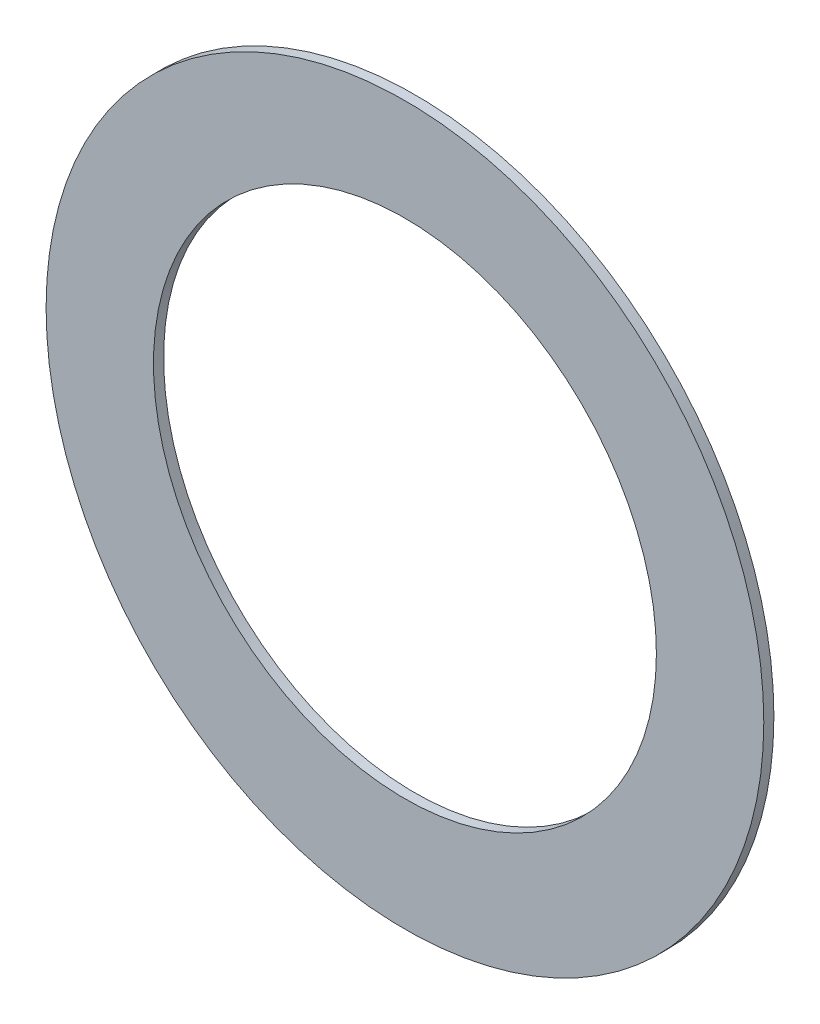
from build123d import *

# Parameters (mm, degrees)
SKETCH1_R           = 142
SKETCH1_R_2         = 99.5
BOSS_EXTRUDE1_DEPTH = 4


with BuildPart() as part:
    # Sketch1 → Boss-Extrude1 (new body)
    with BuildSketch(Plane.XY):
        Circle(SKETCH1_R)
        with Locations((0, 2.203809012)):
            Circle(SKETCH1_R_2, mode=Mode.SUBTRACT)
    extrude(amount=BOSS_EXTRUDE1_DEPTH)


solid = part.part
